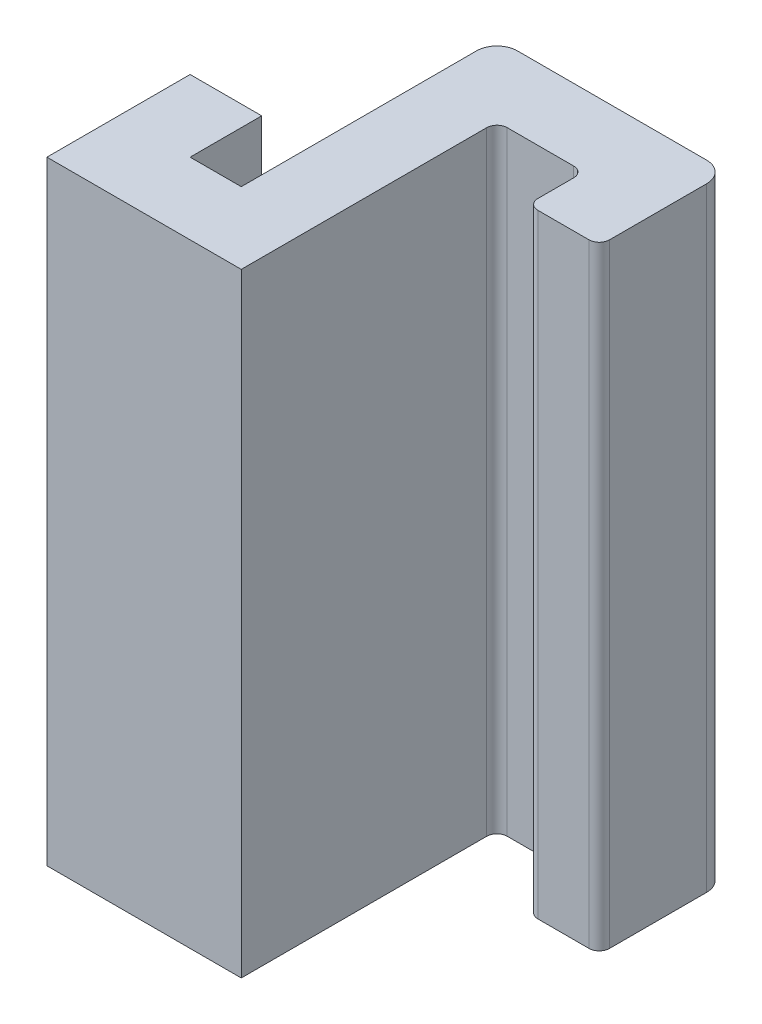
from build123d import *

# Parameters (mm, degrees)
EXTRUDE_1_DEPTH = 60
FILLET_1_R      = 1
FILLET_2_R      = 2
FILLET_3_R      = 2


with BuildPart() as part:
    # Sketch 1 → Extrude 1 (new body)
    with BuildSketch(Plane(origin=(0, 0, 0), x_dir=(1, 0, 0), z_dir=(0, 1, 0))):
        Polygon((0, 0), (-19, 0), (-19, 14), (-12, 14), (-12, 7), (-7, 7), (-7, 32), (15.5, 32), (15.5, 19.5), (8.5, 19.5), (8.5, 25), (0, 25), align=None)
    extrude(amount=EXTRUDE_1_DEPTH)

    # Fillet 1
    fillet_1_edges = [part.edges().sort_by_distance(p)[0] for p in [
        (15.5, 30, -19.5),
        (8.5, 30, -19.5),
        (8.5, 30, -25),
        (0, 30, -25),
    ]]
    fillet(fillet_1_edges, radius=FILLET_1_R)

    # Fillet 2
    fillet_2_edges = [part.edges().sort_by_distance(p)[0] for p in [
        (15.5, 30, -32),
    ]]
    fillet(fillet_2_edges, radius=FILLET_2_R)

    # Fillet 3
    fillet_3_edges = [part.edges().sort_by_distance(p)[0] for p in [
        (-7, 30, -32),
    ]]
    fillet(fillet_3_edges, radius=FILLET_3_R)


solid = part.part
